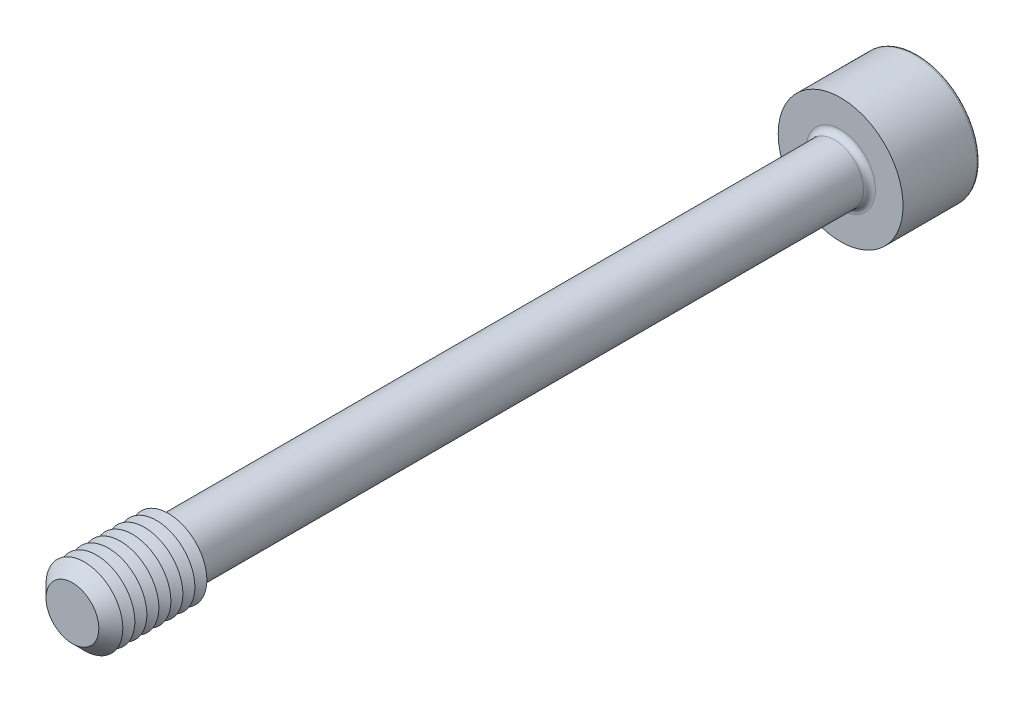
ISO-10303-21;
HEADER;
FILE_DESCRIPTION(('STEP AP214'),'2;1');
FILE_NAME('part.step','',(''),(''),'','','');
FILE_SCHEMA(('AUTOMOTIVE_DESIGN { 1 0 10303 214 1 1 1 1 }'));
ENDSEC;
DATA;
#1=APPLICATION_CONTEXT('core data for automotive mechanical design processes');
#2=APPLICATION_PROTOCOL_DEFINITION('international standard','automotive_design',2000,#1);
#3=PRODUCT_CONTEXT('',#1,'mechanical');
#4=PRODUCT('Part','Part','',(#3));
#5=PRODUCT_RELATED_PRODUCT_CATEGORY('part','',(#4));
#6=PRODUCT_DEFINITION_FORMATION('','',#4);
#7=PRODUCT_DEFINITION_CONTEXT('part definition',#1,'design');
#8=PRODUCT_DEFINITION('design','',#6,#7);
#9=PRODUCT_DEFINITION_SHAPE('','',#8);
#10=(LENGTH_UNIT() NAMED_UNIT(*) SI_UNIT(.MILLI.,.METRE.));
#11=(NAMED_UNIT(*) PLANE_ANGLE_UNIT() SI_UNIT($,.RADIAN.));
#12=(NAMED_UNIT(*) SI_UNIT($,.STERADIAN.) SOLID_ANGLE_UNIT());
#13=UNCERTAINTY_MEASURE_WITH_UNIT(LENGTH_MEASURE(1.E-05),#10,'distance_accuracy_value','');
#14=(GEOMETRIC_REPRESENTATION_CONTEXT(3) GLOBAL_UNCERTAINTY_ASSIGNED_CONTEXT((#13)) GLOBAL_UNIT_ASSIGNED_CONTEXT((#10,
#11,#12)) REPRESENTATION_CONTEXT('',''));
#15=CARTESIAN_POINT('',(0.,0.,0.));
#16=DIRECTION('',(0.,0.,1.));
#17=DIRECTION('',(1.,0.,0.));
#18=AXIS2_PLACEMENT_3D('',#15,#16,#17);
#19=CARTESIAN_POINT('',(-1.73205080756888,-3.,-42.));
#20=DIRECTION('',(0.,0.,1.));
#21=DIRECTION('',(1.,0.,0.));
#22=AXIS2_PLACEMENT_3D('',#19,#20,#21);
#23=PLANE('',#22);
#24=DIRECTION('',(1.,0.,0.));
#25=VECTOR('',#24,1.);
#26=CARTESIAN_POINT('',(-1.73205080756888,-3.,-42.));
#27=LINE('',#26,#25);
#28=CARTESIAN_POINT('',(0.,-3.,-42.));
#29=VERTEX_POINT('',#28);
#30=CARTESIAN_POINT('',(1.73205080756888,-3.,-42.));
#31=VERTEX_POINT('',#30);
#32=EDGE_CURVE('E404',#29,#31,#27,.T.);
#33=ORIENTED_EDGE('',*,*,#32,.F.);
#34=CARTESIAN_POINT('',(0.,0.,-42.));
#35=DIRECTION('',(0.,0.,1.));
#36=DIRECTION('',(0.,-1.,0.));
#37=AXIS2_PLACEMENT_3D('',#34,#35,#36);
#38=CIRCLE('',#37,3.);
#39=CARTESIAN_POINT('',(2.59807621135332,-1.5,-42.));
#40=VERTEX_POINT('',#39);
#41=EDGE_CURVE('E53',#29,#40,#38,.T.);
#42=ORIENTED_EDGE('',*,*,#41,.T.);
#43=DIRECTION('',(0.5,0.866025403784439,0.));
#44=VECTOR('',#43,1.);
#45=CARTESIAN_POINT('',(1.73205080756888,-3.,-42.));
#46=LINE('',#45,#44);
#47=EDGE_CURVE('E394',#31,#40,#46,.T.);
#48=ORIENTED_EDGE('',*,*,#47,.F.);
#49=EDGE_LOOP('',(#33,#42,#48));
#50=FACE_BOUND('',#49,.T.);
#51=ADVANCED_FACE('F41',(#50),#23,.F.);
#52=CARTESIAN_POINT('',(3.46410161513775,0.,-42.));
#53=VERTEX_POINT('',#52);
#54=EDGE_CURVE('E398',#40,#53,#46,.T.);
#55=ORIENTED_EDGE('',*,*,#54,.F.);
#56=CARTESIAN_POINT('',(2.59807621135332,1.5,-42.));
#57=VERTEX_POINT('',#56);
#58=EDGE_CURVE('E11',#40,#57,#38,.T.);
#59=ORIENTED_EDGE('',*,*,#58,.T.);
#60=DIRECTION('',(-0.5,0.866025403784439,0.));
#61=VECTOR('',#60,1.);
#62=CARTESIAN_POINT('',(3.46410161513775,0.,-42.));
#63=LINE('',#62,#61);
#64=EDGE_CURVE('E391',#53,#57,#63,.T.);
#65=ORIENTED_EDGE('',*,*,#64,.F.);
#66=EDGE_LOOP('',(#55,#59,#65));
#67=FACE_BOUND('',#66,.T.);
#68=ADVANCED_FACE('F133',(#67),#23,.F.);
#69=CARTESIAN_POINT('',(1.73205080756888,3.,-42.));
#70=VERTEX_POINT('',#69);
#71=EDGE_CURVE('E390',#57,#70,#63,.T.);
#72=ORIENTED_EDGE('',*,*,#71,.F.);
#73=CARTESIAN_POINT('',(0.,3.,-42.));
#74=VERTEX_POINT('',#73);
#75=EDGE_CURVE('E51',#57,#74,#38,.T.);
#76=ORIENTED_EDGE('',*,*,#75,.T.);
#77=DIRECTION('',(-1.,0.,0.));
#78=VECTOR('',#77,1.);
#79=CARTESIAN_POINT('',(1.73205080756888,3.,-42.));
#80=LINE('',#79,#78);
#81=EDGE_CURVE('E177',#70,#74,#80,.T.);
#82=ORIENTED_EDGE('',*,*,#81,.F.);
#83=EDGE_LOOP('',(#72,#76,#82));
#84=FACE_BOUND('',#83,.T.);
#85=ADVANCED_FACE('F139',(#84),#23,.F.);
#86=CARTESIAN_POINT('',(-1.73205080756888,3.,-42.));
#87=VERTEX_POINT('',#86);
#88=EDGE_CURVE('E395',#74,#87,#80,.T.);
#89=ORIENTED_EDGE('',*,*,#88,.F.);
#90=CARTESIAN_POINT('',(-2.59807621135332,1.5,-42.));
#91=VERTEX_POINT('',#90);
#92=EDGE_CURVE('E264',#74,#91,#38,.T.);
#93=ORIENTED_EDGE('',*,*,#92,.T.);
#94=DIRECTION('',(-0.5,-0.866025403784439,0.));
#95=VECTOR('',#94,1.);
#96=CARTESIAN_POINT('',(-1.73205080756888,3.,-42.));
#97=LINE('',#96,#95);
#98=EDGE_CURVE('E176',#87,#91,#97,.T.);
#99=ORIENTED_EDGE('',*,*,#98,.F.);
#100=EDGE_LOOP('',(#89,#93,#99));
#101=FACE_BOUND('',#100,.T.);
#102=ADVANCED_FACE('F157',(#101),#23,.F.);
#103=CARTESIAN_POINT('',(-3.46410161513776,0.,-42.));
#104=VERTEX_POINT('',#103);
#105=EDGE_CURVE('E170',#91,#104,#97,.T.);
#106=ORIENTED_EDGE('',*,*,#105,.F.);
#107=CARTESIAN_POINT('',(-2.59807621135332,-1.5,-42.));
#108=VERTEX_POINT('',#107);
#109=EDGE_CURVE('E172',#91,#108,#38,.T.);
#110=ORIENTED_EDGE('',*,*,#109,.T.);
#111=DIRECTION('',(0.5,-0.866025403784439,0.));
#112=VECTOR('',#111,1.);
#113=CARTESIAN_POINT('',(-3.46410161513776,0.,-42.));
#114=LINE('',#113,#112);
#115=EDGE_CURVE('E174',#104,#108,#114,.T.);
#116=ORIENTED_EDGE('',*,*,#115,.F.);
#117=EDGE_LOOP('',(#106,#110,#116));
#118=FACE_BOUND('',#117,.T.);
#119=ADVANCED_FACE('F146',(#118),#23,.F.);
#120=CARTESIAN_POINT('',(0.,0.,-48.));
#121=DIRECTION('',(0.,0.,-1.));
#122=DIRECTION('',(-1.,0.,0.));
#123=AXIS2_PLACEMENT_3D('',#120,#121,#122);
#124=PLANE('',#123);
#125=CARTESIAN_POINT('',(0.,0.,-48.));
#126=DIRECTION('',(0.,0.,-1.));
#127=DIRECTION('',(-1.,0.,0.));
#128=AXIS2_PLACEMENT_3D('',#125,#126,#127);
#129=CIRCLE('',#128,6.19);
#130=CARTESIAN_POINT('',(-6.19,0.,-48.));
#131=VERTEX_POINT('',#130);
#132=EDGE_CURVE('E249',#131,#131,#129,.T.);
#133=ORIENTED_EDGE('',*,*,#132,.T.);
#134=EDGE_LOOP('',(#133));
#135=FACE_BOUND('',#134,.T.);
#136=DIRECTION('',(-0.5,-0.866025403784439,0.));
#137=VECTOR('',#136,1.);
#138=CARTESIAN_POINT('',(-1.73205080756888,3.,-48.));
#139=LINE('',#138,#137);
#140=CARTESIAN_POINT('',(-1.73205080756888,3.,-48.));
#141=VERTEX_POINT('',#140);
#142=CARTESIAN_POINT('',(-3.46410161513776,0.,-48.));
#143=VERTEX_POINT('',#142);
#144=EDGE_CURVE('E211',#141,#143,#139,.T.);
#145=ORIENTED_EDGE('',*,*,#144,.T.);
#146=DIRECTION('',(0.5,-0.866025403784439,0.));
#147=VECTOR('',#146,1.);
#148=CARTESIAN_POINT('',(-3.46410161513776,0.,-48.));
#149=LINE('',#148,#147);
#150=CARTESIAN_POINT('',(-1.73205080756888,-3.,-48.));
#151=VERTEX_POINT('',#150);
#152=EDGE_CURVE('E67',#143,#151,#149,.T.);
#153=ORIENTED_EDGE('',*,*,#152,.T.);
#154=DIRECTION('',(1.,0.,0.));
#155=VECTOR('',#154,1.);
#156=CARTESIAN_POINT('',(-1.73205080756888,-3.,-48.));
#157=LINE('',#156,#155);
#158=CARTESIAN_POINT('',(1.73205080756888,-3.,-48.));
#159=VERTEX_POINT('',#158);
#160=EDGE_CURVE('E195',#151,#159,#157,.T.);
#161=ORIENTED_EDGE('',*,*,#160,.T.);
#162=DIRECTION('',(0.5,0.866025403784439,0.));
#163=VECTOR('',#162,1.);
#164=CARTESIAN_POINT('',(1.73205080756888,-3.,-48.));
#165=LINE('',#164,#163);
#166=CARTESIAN_POINT('',(3.46410161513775,0.,-48.));
#167=VERTEX_POINT('',#166);
#168=EDGE_CURVE('E199',#159,#167,#165,.T.);
#169=ORIENTED_EDGE('',*,*,#168,.T.);
#170=DIRECTION('',(-0.5,0.866025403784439,0.));
#171=VECTOR('',#170,1.);
#172=CARTESIAN_POINT('',(3.46410161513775,0.,-48.));
#173=LINE('',#172,#171);
#174=CARTESIAN_POINT('',(1.73205080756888,3.,-48.));
#175=VERTEX_POINT('',#174);
#176=EDGE_CURVE('E203',#167,#175,#173,.T.);
#177=ORIENTED_EDGE('',*,*,#176,.T.);
#178=DIRECTION('',(-1.,0.,0.));
#179=VECTOR('',#178,1.);
#180=CARTESIAN_POINT('',(1.73205080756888,3.,-48.));
#181=LINE('',#180,#179);
#182=EDGE_CURVE('E207',#175,#141,#181,.T.);
#183=ORIENTED_EDGE('',*,*,#182,.T.);
#184=EDGE_LOOP('',(#145,#153,#161,#169,#177,#183));
#185=FACE_BOUND('',#184,.T.);
#186=ADVANCED_FACE('F156',(#135,#185),#124,.T.);
#187=CARTESIAN_POINT('',(0.,0.,40.));
#188=DIRECTION('',(0.,0.,-1.));
#189=DIRECTION('',(-1.,0.,0.));
#190=AXIS2_PLACEMENT_3D('',#187,#188,#189);
#191=CYLINDRICAL_SURFACE('',#190,3.);
#192=CARTESIAN_POINT('',(0.,0.,-39.38));
#193=DIRECTION('',(0.,0.,-1.));
#194=DIRECTION('',(-1.,0.,0.));
#195=AXIS2_PLACEMENT_3D('',#192,#193,#194);
#196=CIRCLE('',#195,3.);
#197=CARTESIAN_POINT('',(-3.,0.,-39.38));
#198=VERTEX_POINT('',#197);
#199=EDGE_CURVE('E246',#198,#198,#196,.F.);
#200=ORIENTED_EDGE('',*,*,#199,.T.);
#201=EDGE_LOOP('',(#200));
#202=FACE_BOUND('',#201,.T.);
#203=CARTESIAN_POINT('',(0.,0.,29.4226497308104));
#204=DIRECTION('',(0.,0.,-1.));
#205=DIRECTION('',(0.,1.,0.));
#206=AXIS2_PLACEMENT_3D('',#203,#204,#205);
#207=CIRCLE('',#206,3.);
#208=CARTESIAN_POINT('',(0.,3.,29.4226497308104));
#209=VERTEX_POINT('',#208);
#210=EDGE_CURVE('E234',#209,#209,#207,.T.);
#211=ORIENTED_EDGE('',*,*,#210,.T.);
#212=EDGE_LOOP('',(#211));
#213=FACE_BOUND('',#212,.T.);
#214=ADVANCED_FACE('F163',(#202,#213),#191,.T.);
#215=CARTESIAN_POINT('',(0.,0.,29.4226497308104));
#216=DIRECTION('',(0.,0.,1.));
#217=DIRECTION('',(0.,-1.,0.));
#218=AXIS2_PLACEMENT_3D('',#215,#216,#217);
#219=CONICAL_SURFACE('',#218,3.,1.0471975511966);
#220=CARTESIAN_POINT('',(0.,0.,30.));
#221=DIRECTION('',(0.,0.,-1.));
#222=DIRECTION('',(-1.,0.,0.));
#223=AXIS2_PLACEMENT_3D('',#220,#221,#222);
#224=CIRCLE('',#223,4.);
#225=CARTESIAN_POINT('',(-4.,0.,30.));
#226=VERTEX_POINT('',#225);
#227=EDGE_CURVE('E268',#226,#226,#224,.T.);
#228=ORIENTED_EDGE('',*,*,#227,.T.);
#229=EDGE_LOOP('',(#228));
#230=FACE_BOUND('',#229,.T.);
#231=ORIENTED_EDGE('',*,*,#210,.F.);
#232=EDGE_LOOP('',(#231));
#233=FACE_BOUND('',#232,.T.);
#234=ADVANCED_FACE('F348',(#230,#233),#219,.T.);
#235=CARTESIAN_POINT('',(0.,0.,-40.));
#236=DIRECTION('',(0.,0.,-1.));
#237=DIRECTION('',(-1.,0.,0.));
#238=AXIS2_PLACEMENT_3D('',#235,#236,#237);
#239=PLANE('',#238);
#240=CARTESIAN_POINT('',(0.,0.,-40.));
#241=DIRECTION('',(0.,0.,-1.));
#242=DIRECTION('',(-1.,0.,0.));
#243=AXIS2_PLACEMENT_3D('',#240,#241,#242);
#244=CIRCLE('',#243,3.62);
#245=CARTESIAN_POINT('',(-3.62,0.,-40.));
#246=VERTEX_POINT('',#245);
#247=EDGE_CURVE('E242',#246,#246,#244,.T.);
#248=ORIENTED_EDGE('',*,*,#247,.T.);
#249=EDGE_LOOP('',(#248));
#250=FACE_BOUND('',#249,.T.);
#251=CARTESIAN_POINT('',(0.,0.,-40.));
#252=DIRECTION('',(0.,0.,-1.));
#253=DIRECTION('',(-1.,0.,0.));
#254=AXIS2_PLACEMENT_3D('',#251,#252,#253);
#255=CIRCLE('',#254,6.5);
#256=CARTESIAN_POINT('',(-6.5,0.,-40.));
#257=VERTEX_POINT('',#256);
#258=EDGE_CURVE('E230',#257,#257,#255,.T.);
#259=ORIENTED_EDGE('',*,*,#258,.F.);
#260=EDGE_LOOP('',(#259));
#261=FACE_BOUND('',#260,.T.);
#262=ADVANCED_FACE('F353',(#250,#261),#239,.F.);
#263=CARTESIAN_POINT('',(0.,0.,-48.));
#264=DIRECTION('',(0.,0.,1.));
#265=DIRECTION('',(1.,0.,0.));
#266=AXIS2_PLACEMENT_3D('',#263,#264,#265);
#267=CYLINDRICAL_SURFACE('',#266,6.5);
#268=CARTESIAN_POINT('',(0.,0.,-47.69));
#269=DIRECTION('',(0.,0.,-1.));
#270=DIRECTION('',(-1.,0.,0.));
#271=AXIS2_PLACEMENT_3D('',#268,#269,#270);
#272=CIRCLE('',#271,6.5);
#273=CARTESIAN_POINT('',(-6.5,0.,-47.69));
#274=VERTEX_POINT('',#273);
#275=EDGE_CURVE('E45',#274,#274,#272,.F.);
#276=ORIENTED_EDGE('',*,*,#275,.T.);
#277=EDGE_LOOP('',(#276));
#278=FACE_BOUND('',#277,.T.);
#279=ORIENTED_EDGE('',*,*,#258,.T.);
#280=EDGE_LOOP('',(#279));
#281=FACE_BOUND('',#280,.T.);
#282=ADVANCED_FACE('F354',(#278,#281),#267,.T.);
#283=CARTESIAN_POINT('',(-3.46410161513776,0.,-42.));
#284=DIRECTION('',(0.866025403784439,0.5,0.));
#285=DIRECTION('',(-0.5,0.866025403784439,0.));
#286=AXIS2_PLACEMENT_3D('',#283,#284,#285);
#287=PLANE('',#286);
#288=ORIENTED_EDGE('',*,*,#152,.F.);
#289=DIRECTION('',(0.,0.,-1.));
#290=VECTOR('',#289,1.);
#291=CARTESIAN_POINT('',(-3.46410161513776,0.,-42.));
#292=LINE('',#291,#290);
#293=EDGE_CURVE('E186',#104,#143,#292,.T.);
#294=ORIENTED_EDGE('',*,*,#293,.F.);
#295=ORIENTED_EDGE('',*,*,#115,.T.);
#296=CARTESIAN_POINT('',(-1.73205080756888,-3.,-42.));
#297=VERTEX_POINT('',#296);
#298=EDGE_CURVE('E214',#108,#297,#114,.T.);
#299=ORIENTED_EDGE('',*,*,#298,.T.);
#300=DIRECTION('',(0.,0.,-1.));
#301=VECTOR('',#300,1.);
#302=CARTESIAN_POINT('',(-1.73205080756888,-3.,-42.));
#303=LINE('',#302,#301);
#304=EDGE_CURVE('E227',#297,#151,#303,.T.);
#305=ORIENTED_EDGE('',*,*,#304,.T.);
#306=EDGE_LOOP('',(#288,#294,#295,#299,#305));
#307=FACE_BOUND('',#306,.T.);
#308=ADVANCED_FACE('F357',(#307),#287,.T.);
#309=CARTESIAN_POINT('',(-1.73205080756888,-3.,-42.));
#310=DIRECTION('',(0.,1.,0.));
#311=DIRECTION('',(0.,0.,1.));
#312=AXIS2_PLACEMENT_3D('',#309,#310,#311);
#313=PLANE('',#312);
#314=ORIENTED_EDGE('',*,*,#160,.F.);
#315=ORIENTED_EDGE('',*,*,#304,.F.);
#316=EDGE_CURVE('E401',#297,#29,#27,.T.);
#317=ORIENTED_EDGE('',*,*,#316,.T.);
#318=ORIENTED_EDGE('',*,*,#32,.T.);
#319=DIRECTION('',(0.,0.,-1.));
#320=VECTOR('',#319,1.);
#321=CARTESIAN_POINT('',(1.73205080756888,-3.,-42.));
#322=LINE('',#321,#320);
#323=EDGE_CURVE('E224',#31,#159,#322,.T.);
#324=ORIENTED_EDGE('',*,*,#323,.T.);
#325=EDGE_LOOP('',(#314,#315,#317,#318,#324));
#326=FACE_BOUND('',#325,.T.);
#327=ADVANCED_FACE('F363',(#326),#313,.T.);
#328=CARTESIAN_POINT('',(1.73205080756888,-3.,-42.));
#329=DIRECTION('',(-0.866025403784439,0.5,0.));
#330=DIRECTION('',(-0.5,-0.866025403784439,0.));
#331=AXIS2_PLACEMENT_3D('',#328,#329,#330);
#332=PLANE('',#331);
#333=ORIENTED_EDGE('',*,*,#168,.F.);
#334=ORIENTED_EDGE('',*,*,#323,.F.);
#335=ORIENTED_EDGE('',*,*,#47,.T.);
#336=ORIENTED_EDGE('',*,*,#54,.T.);
#337=DIRECTION('',(0.,0.,-1.));
#338=VECTOR('',#337,1.);
#339=CARTESIAN_POINT('',(3.46410161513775,0.,-42.));
#340=LINE('',#339,#338);
#341=EDGE_CURVE('E221',#53,#167,#340,.T.);
#342=ORIENTED_EDGE('',*,*,#341,.T.);
#343=EDGE_LOOP('',(#333,#334,#335,#336,#342));
#344=FACE_BOUND('',#343,.T.);
#345=ADVANCED_FACE('F366',(#344),#332,.T.);
#346=CARTESIAN_POINT('',(3.46410161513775,0.,-42.));
#347=DIRECTION('',(-0.866025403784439,-0.5,0.));
#348=DIRECTION('',(0.5,-0.866025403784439,0.));
#349=AXIS2_PLACEMENT_3D('',#346,#347,#348);
#350=PLANE('',#349);
#351=ORIENTED_EDGE('',*,*,#176,.F.);
#352=ORIENTED_EDGE('',*,*,#341,.F.);
#353=ORIENTED_EDGE('',*,*,#64,.T.);
#354=ORIENTED_EDGE('',*,*,#71,.T.);
#355=DIRECTION('',(0.,0.,-1.));
#356=VECTOR('',#355,1.);
#357=CARTESIAN_POINT('',(1.73205080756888,3.,-42.));
#358=LINE('',#357,#356);
#359=EDGE_CURVE('E218',#70,#175,#358,.T.);
#360=ORIENTED_EDGE('',*,*,#359,.T.);
#361=EDGE_LOOP('',(#351,#352,#353,#354,#360));
#362=FACE_BOUND('',#361,.T.);
#363=ADVANCED_FACE('F370',(#362),#350,.T.);
#364=CARTESIAN_POINT('',(1.73205080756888,3.,-42.));
#365=DIRECTION('',(0.,-1.,0.));
#366=DIRECTION('',(1.,0.,0.));
#367=AXIS2_PLACEMENT_3D('',#364,#365,#366);
#368=PLANE('',#367);
#369=ORIENTED_EDGE('',*,*,#182,.F.);
#370=ORIENTED_EDGE('',*,*,#359,.F.);
#371=ORIENTED_EDGE('',*,*,#81,.T.);
#372=ORIENTED_EDGE('',*,*,#88,.T.);
#373=DIRECTION('',(0.,0.,-1.));
#374=VECTOR('',#373,1.);
#375=CARTESIAN_POINT('',(-1.73205080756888,3.,-42.));
#376=LINE('',#375,#374);
#377=EDGE_CURVE('E182',#87,#141,#376,.T.);
#378=ORIENTED_EDGE('',*,*,#377,.T.);
#379=EDGE_LOOP('',(#369,#370,#371,#372,#378));
#380=FACE_BOUND('',#379,.T.);
#381=ADVANCED_FACE('F152',(#380),#368,.T.);
#382=CARTESIAN_POINT('',(-1.73205080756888,3.,-42.));
#383=DIRECTION('',(0.866025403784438,-0.5,0.));
#384=DIRECTION('',(0.5,0.866025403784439,0.));
#385=AXIS2_PLACEMENT_3D('',#382,#383,#384);
#386=PLANE('',#385);
#387=ORIENTED_EDGE('',*,*,#144,.F.);
#388=ORIENTED_EDGE('',*,*,#377,.F.);
#389=ORIENTED_EDGE('',*,*,#98,.T.);
#390=ORIENTED_EDGE('',*,*,#105,.T.);
#391=ORIENTED_EDGE('',*,*,#293,.T.);
#392=EDGE_LOOP('',(#387,#388,#389,#390,#391));
#393=FACE_BOUND('',#392,.T.);
#394=ADVANCED_FACE('F144',(#393),#386,.T.);
#395=ORIENTED_EDGE('',*,*,#298,.F.);
#396=EDGE_CURVE('E255',#108,#29,#38,.T.);
#397=ORIENTED_EDGE('',*,*,#396,.T.);
#398=ORIENTED_EDGE('',*,*,#316,.F.);
#399=EDGE_LOOP('',(#395,#397,#398));
#400=FACE_BOUND('',#399,.T.);
#401=ADVANCED_FACE('F135',(#400),#23,.F.);
#402=CARTESIAN_POINT('',(0.,0.,-39.38));
#403=DIRECTION('',(0.,0.,-1.));
#404=DIRECTION('',(-1.,0.,0.));
#405=AXIS2_PLACEMENT_3D('',#402,#403,#404);
#406=TOROIDAL_SURFACE('',#405,3.62,0.62);
#407=ORIENTED_EDGE('',*,*,#199,.F.);
#408=EDGE_LOOP('',(#407));
#409=FACE_BOUND('',#408,.T.);
#410=ORIENTED_EDGE('',*,*,#247,.F.);
#411=EDGE_LOOP('',(#410));
#412=FACE_BOUND('',#411,.T.);
#413=ADVANCED_FACE('F129',(#409,#412),#406,.F.);
#414=CARTESIAN_POINT('',(0.,0.,-47.69));
#415=DIRECTION('',(0.,0.,-1.));
#416=DIRECTION('',(-1.,0.,0.));
#417=AXIS2_PLACEMENT_3D('',#414,#415,#416);
#418=TOROIDAL_SURFACE('',#417,6.19,0.31);
#419=ORIENTED_EDGE('',*,*,#275,.F.);
#420=EDGE_LOOP('',(#419));
#421=FACE_BOUND('',#420,.T.);
#422=ORIENTED_EDGE('',*,*,#132,.F.);
#423=EDGE_LOOP('',(#422));
#424=FACE_BOUND('',#423,.T.);
#425=ADVANCED_FACE('F43',(#421,#424),#418,.T.);
#426=CARTESIAN_POINT('',(0.,0.,-40.2679491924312));
#427=DIRECTION('',(0.,0.,-1.));
#428=DIRECTION('',(0.,1.,0.));
#429=AXIS2_PLACEMENT_3D('',#426,#427,#428);
#430=CONICAL_SURFACE('',#429,0.,1.04719755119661);
#431=ORIENTED_EDGE('',*,*,#41,.F.);
#432=ORIENTED_EDGE('',*,*,#396,.F.);
#433=ORIENTED_EDGE('',*,*,#109,.F.);
#434=ORIENTED_EDGE('',*,*,#92,.F.);
#435=ORIENTED_EDGE('',*,*,#75,.F.);
#436=ORIENTED_EDGE('',*,*,#58,.F.);
#437=EDGE_LOOP('',(#431,#432,#433,#434,#435,#436));
#438=FACE_BOUND('',#437,.T.);
#439=CARTESIAN_POINT('',(0.,0.,-40.2679491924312));
#440=VERTEX_POINT('',#439);
#441=VERTEX_LOOP('',#440);
#442=FACE_BOUND('',#441,.T.);
#443=ADVANCED_FACE('F118',(#438,#442),#430,.F.);
#444=CARTESIAN_POINT('',(0.,0.,30.625));
#445=DIRECTION('',(0.,0.,-1.));
#446=DIRECTION('',(-1.,0.,0.));
#447=AXIS2_PLACEMENT_3D('',#444,#445,#446);
#448=CONICAL_SURFACE('',#447,2.91746824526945,1.0471975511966);
#449=ORIENTED_EDGE('',*,*,#227,.F.);
#450=EDGE_LOOP('',(#449));
#451=FACE_BOUND('',#450,.T.);
#452=CARTESIAN_POINT('',(0.,0.,30.625));
#453=DIRECTION('',(0.,0.,-1.));
#454=DIRECTION('',(-1.,0.,0.));
#455=AXIS2_PLACEMENT_3D('',#452,#453,#454);
#456=CIRCLE('',#455,2.91746824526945);
#457=CARTESIAN_POINT('',(-2.91746824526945,0.,30.625));
#458=VERTEX_POINT('',#457);
#459=EDGE_CURVE('E274',#458,#458,#456,.T.);
#460=ORIENTED_EDGE('',*,*,#459,.T.);
#461=EDGE_LOOP('',(#460));
#462=FACE_BOUND('',#461,.T.);
#463=ADVANCED_FACE('F120',(#451,#462),#448,.T.);
#464=CARTESIAN_POINT('',(0.,0.,31.25));
#465=DIRECTION('',(0.,0.,1.));
#466=DIRECTION('',(1.,0.,0.));
#467=AXIS2_PLACEMENT_3D('',#464,#465,#466);
#468=CONICAL_SURFACE('',#467,4.,1.0471975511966);
#469=ORIENTED_EDGE('',*,*,#459,.F.);
#470=EDGE_LOOP('',(#469));
#471=FACE_BOUND('',#470,.T.);
#472=CARTESIAN_POINT('',(0.,0.,31.25));
#473=DIRECTION('',(0.,0.,-1.));
#474=DIRECTION('',(-1.,0.,0.));
#475=AXIS2_PLACEMENT_3D('',#472,#473,#474);
#476=CIRCLE('',#475,4.);
#477=CARTESIAN_POINT('',(-4.,0.,31.25));
#478=VERTEX_POINT('',#477);
#479=EDGE_CURVE('E281',#478,#478,#476,.T.);
#480=ORIENTED_EDGE('',*,*,#479,.T.);
#481=EDGE_LOOP('',(#480));
#482=FACE_BOUND('',#481,.T.);
#483=ADVANCED_FACE('F126',(#471,#482),#468,.T.);
#484=CARTESIAN_POINT('',(0.,0.,31.875));
#485=DIRECTION('',(0.,0.,-1.));
#486=DIRECTION('',(-1.,0.,0.));
#487=AXIS2_PLACEMENT_3D('',#484,#485,#486);
#488=CONICAL_SURFACE('',#487,2.91746824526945,1.0471975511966);
#489=ORIENTED_EDGE('',*,*,#479,.F.);
#490=EDGE_LOOP('',(#489));
#491=FACE_BOUND('',#490,.T.);
#492=CARTESIAN_POINT('',(0.,0.,31.875));
#493=DIRECTION('',(0.,0.,-1.));
#494=DIRECTION('',(-1.,0.,0.));
#495=AXIS2_PLACEMENT_3D('',#492,#493,#494);
#496=CIRCLE('',#495,2.91746824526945);
#497=CARTESIAN_POINT('',(-2.91746824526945,0.,31.875));
#498=VERTEX_POINT('',#497);
#499=EDGE_CURVE('E287',#498,#498,#496,.T.);
#500=ORIENTED_EDGE('',*,*,#499,.T.);
#501=EDGE_LOOP('',(#500));
#502=FACE_BOUND('',#501,.T.);
#503=ADVANCED_FACE('F508',(#491,#502),#488,.T.);
#504=CARTESIAN_POINT('',(0.,0.,32.5));
#505=DIRECTION('',(0.,0.,1.));
#506=DIRECTION('',(1.,0.,0.));
#507=AXIS2_PLACEMENT_3D('',#504,#505,#506);
#508=CONICAL_SURFACE('',#507,4.,1.0471975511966);
#509=ORIENTED_EDGE('',*,*,#499,.F.);
#510=EDGE_LOOP('',(#509));
#511=FACE_BOUND('',#510,.T.);
#512=CARTESIAN_POINT('',(0.,0.,32.5));
#513=DIRECTION('',(0.,0.,-1.));
#514=DIRECTION('',(-1.,0.,0.));
#515=AXIS2_PLACEMENT_3D('',#512,#513,#514);
#516=CIRCLE('',#515,4.);
#517=CARTESIAN_POINT('',(-4.,0.,32.5));
#518=VERTEX_POINT('',#517);
#519=EDGE_CURVE('E291',#518,#518,#516,.T.);
#520=ORIENTED_EDGE('',*,*,#519,.T.);
#521=EDGE_LOOP('',(#520));
#522=FACE_BOUND('',#521,.T.);
#523=ADVANCED_FACE('F517',(#511,#522),#508,.T.);
#524=CARTESIAN_POINT('',(0.,0.,33.125));
#525=DIRECTION('',(0.,0.,-1.));
#526=DIRECTION('',(-1.,0.,0.));
#527=AXIS2_PLACEMENT_3D('',#524,#525,#526);
#528=CONICAL_SURFACE('',#527,2.91746824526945,1.0471975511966);
#529=ORIENTED_EDGE('',*,*,#519,.F.);
#530=EDGE_LOOP('',(#529));
#531=FACE_BOUND('',#530,.T.);
#532=CARTESIAN_POINT('',(0.,0.,33.125));
#533=DIRECTION('',(0.,0.,-1.));
#534=DIRECTION('',(-1.,0.,0.));
#535=AXIS2_PLACEMENT_3D('',#532,#533,#534);
#536=CIRCLE('',#535,2.91746824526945);
#537=CARTESIAN_POINT('',(-2.91746824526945,0.,33.125));
#538=VERTEX_POINT('',#537);
#539=EDGE_CURVE('E294',#538,#538,#536,.T.);
#540=ORIENTED_EDGE('',*,*,#539,.T.);
#541=EDGE_LOOP('',(#540));
#542=FACE_BOUND('',#541,.T.);
#543=ADVANCED_FACE('F526',(#531,#542),#528,.T.);
#544=CARTESIAN_POINT('',(0.,0.,33.75));
#545=DIRECTION('',(0.,0.,1.));
#546=DIRECTION('',(1.,0.,0.));
#547=AXIS2_PLACEMENT_3D('',#544,#545,#546);
#548=CONICAL_SURFACE('',#547,4.,1.0471975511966);
#549=ORIENTED_EDGE('',*,*,#539,.F.);
#550=EDGE_LOOP('',(#549));
#551=FACE_BOUND('',#550,.T.);
#552=CARTESIAN_POINT('',(0.,0.,33.75));
#553=DIRECTION('',(0.,0.,-1.));
#554=DIRECTION('',(-1.,0.,0.));
#555=AXIS2_PLACEMENT_3D('',#552,#553,#554);
#556=CIRCLE('',#555,4.);
#557=CARTESIAN_POINT('',(-4.,0.,33.75));
#558=VERTEX_POINT('',#557);
#559=EDGE_CURVE('E298',#558,#558,#556,.T.);
#560=ORIENTED_EDGE('',*,*,#559,.T.);
#561=EDGE_LOOP('',(#560));
#562=FACE_BOUND('',#561,.T.);
#563=ADVANCED_FACE('F535',(#551,#562),#548,.T.);
#564=CARTESIAN_POINT('',(0.,0.,34.375));
#565=DIRECTION('',(0.,0.,-1.));
#566=DIRECTION('',(-1.,0.,0.));
#567=AXIS2_PLACEMENT_3D('',#564,#565,#566);
#568=CONICAL_SURFACE('',#567,2.91746824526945,1.0471975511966);
#569=ORIENTED_EDGE('',*,*,#559,.F.);
#570=EDGE_LOOP('',(#569));
#571=FACE_BOUND('',#570,.T.);
#572=CARTESIAN_POINT('',(0.,0.,34.375));
#573=DIRECTION('',(0.,0.,-1.));
#574=DIRECTION('',(-1.,0.,0.));
#575=AXIS2_PLACEMENT_3D('',#572,#573,#574);
#576=CIRCLE('',#575,2.91746824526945);
#577=CARTESIAN_POINT('',(-2.91746824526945,0.,34.375));
#578=VERTEX_POINT('',#577);
#579=EDGE_CURVE('E301',#578,#578,#576,.T.);
#580=ORIENTED_EDGE('',*,*,#579,.T.);
#581=EDGE_LOOP('',(#580));
#582=FACE_BOUND('',#581,.T.);
#583=ADVANCED_FACE('F544',(#571,#582),#568,.T.);
#584=CARTESIAN_POINT('',(0.,0.,35.));
#585=DIRECTION('',(0.,0.,1.));
#586=DIRECTION('',(1.,0.,0.));
#587=AXIS2_PLACEMENT_3D('',#584,#585,#586);
#588=CONICAL_SURFACE('',#587,4.,1.0471975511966);
#589=ORIENTED_EDGE('',*,*,#579,.F.);
#590=EDGE_LOOP('',(#589));
#591=FACE_BOUND('',#590,.T.);
#592=CARTESIAN_POINT('',(0.,0.,35.));
#593=DIRECTION('',(0.,0.,-1.));
#594=DIRECTION('',(-1.,0.,0.));
#595=AXIS2_PLACEMENT_3D('',#592,#593,#594);
#596=CIRCLE('',#595,4.);
#597=CARTESIAN_POINT('',(-4.,0.,35.));
#598=VERTEX_POINT('',#597);
#599=EDGE_CURVE('E304',#598,#598,#596,.T.);
#600=ORIENTED_EDGE('',*,*,#599,.T.);
#601=EDGE_LOOP('',(#600));
#602=FACE_BOUND('',#601,.T.);
#603=ADVANCED_FACE('F553',(#591,#602),#588,.T.);
#604=CARTESIAN_POINT('',(0.,0.,35.625));
#605=DIRECTION('',(0.,0.,-1.));
#606=DIRECTION('',(-1.,0.,0.));
#607=AXIS2_PLACEMENT_3D('',#604,#605,#606);
#608=CONICAL_SURFACE('',#607,2.91746824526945,1.0471975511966);
#609=ORIENTED_EDGE('',*,*,#599,.F.);
#610=EDGE_LOOP('',(#609));
#611=FACE_BOUND('',#610,.T.);
#612=CARTESIAN_POINT('',(0.,0.,35.625));
#613=DIRECTION('',(0.,0.,-1.));
#614=DIRECTION('',(-1.,0.,0.));
#615=AXIS2_PLACEMENT_3D('',#612,#613,#614);
#616=CIRCLE('',#615,2.91746824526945);
#617=CARTESIAN_POINT('',(-2.91746824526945,0.,35.625));
#618=VERTEX_POINT('',#617);
#619=EDGE_CURVE('E308',#618,#618,#616,.T.);
#620=ORIENTED_EDGE('',*,*,#619,.T.);
#621=EDGE_LOOP('',(#620));
#622=FACE_BOUND('',#621,.T.);
#623=ADVANCED_FACE('F562',(#611,#622),#608,.T.);
#624=CARTESIAN_POINT('',(0.,0.,36.25));
#625=DIRECTION('',(0.,0.,1.));
#626=DIRECTION('',(1.,0.,0.));
#627=AXIS2_PLACEMENT_3D('',#624,#625,#626);
#628=CONICAL_SURFACE('',#627,4.,1.0471975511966);
#629=ORIENTED_EDGE('',*,*,#619,.F.);
#630=EDGE_LOOP('',(#629));
#631=FACE_BOUND('',#630,.T.);
#632=CARTESIAN_POINT('',(0.,0.,36.25));
#633=DIRECTION('',(0.,0.,-1.));
#634=DIRECTION('',(-1.,0.,0.));
#635=AXIS2_PLACEMENT_3D('',#632,#633,#634);
#636=CIRCLE('',#635,4.);
#637=CARTESIAN_POINT('',(-4.,0.,36.25));
#638=VERTEX_POINT('',#637);
#639=EDGE_CURVE('E312',#638,#638,#636,.T.);
#640=ORIENTED_EDGE('',*,*,#639,.T.);
#641=EDGE_LOOP('',(#640));
#642=FACE_BOUND('',#641,.T.);
#643=ADVANCED_FACE('F571',(#631,#642),#628,.T.);
#644=CARTESIAN_POINT('',(0.,0.,36.875));
#645=DIRECTION('',(0.,0.,-1.));
#646=DIRECTION('',(-1.,0.,0.));
#647=AXIS2_PLACEMENT_3D('',#644,#645,#646);
#648=CONICAL_SURFACE('',#647,2.91746824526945,1.0471975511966);
#649=ORIENTED_EDGE('',*,*,#639,.F.);
#650=EDGE_LOOP('',(#649));
#651=FACE_BOUND('',#650,.T.);
#652=CARTESIAN_POINT('',(0.,0.,36.875));
#653=DIRECTION('',(0.,0.,-1.));
#654=DIRECTION('',(-1.,0.,0.));
#655=AXIS2_PLACEMENT_3D('',#652,#653,#654);
#656=CIRCLE('',#655,2.91746824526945);
#657=CARTESIAN_POINT('',(-2.91746824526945,0.,36.875));
#658=VERTEX_POINT('',#657);
#659=EDGE_CURVE('E316',#658,#658,#656,.T.);
#660=ORIENTED_EDGE('',*,*,#659,.T.);
#661=EDGE_LOOP('',(#660));
#662=FACE_BOUND('',#661,.T.);
#663=ADVANCED_FACE('F580',(#651,#662),#648,.T.);
#664=CARTESIAN_POINT('',(0.,0.,37.5));
#665=DIRECTION('',(0.,0.,1.));
#666=DIRECTION('',(1.,0.,0.));
#667=AXIS2_PLACEMENT_3D('',#664,#665,#666);
#668=CONICAL_SURFACE('',#667,4.,1.0471975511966);
#669=ORIENTED_EDGE('',*,*,#659,.F.);
#670=EDGE_LOOP('',(#669));
#671=FACE_BOUND('',#670,.T.);
#672=CARTESIAN_POINT('',(0.,0.,37.5));
#673=DIRECTION('',(0.,0.,-1.));
#674=DIRECTION('',(-1.,0.,0.));
#675=AXIS2_PLACEMENT_3D('',#672,#673,#674);
#676=CIRCLE('',#675,4.);
#677=CARTESIAN_POINT('',(-4.,0.,37.5));
#678=VERTEX_POINT('',#677);
#679=EDGE_CURVE('E320',#678,#678,#676,.T.);
#680=ORIENTED_EDGE('',*,*,#679,.T.);
#681=EDGE_LOOP('',(#680));
#682=FACE_BOUND('',#681,.T.);
#683=ADVANCED_FACE('F589',(#671,#682),#668,.T.);
#684=CARTESIAN_POINT('',(0.,0.,38.125));
#685=DIRECTION('',(0.,0.,-1.));
#686=DIRECTION('',(-1.,0.,0.));
#687=AXIS2_PLACEMENT_3D('',#684,#685,#686);
#688=CONICAL_SURFACE('',#687,2.91746824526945,1.0471975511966);
#689=ORIENTED_EDGE('',*,*,#679,.F.);
#690=EDGE_LOOP('',(#689));
#691=FACE_BOUND('',#690,.T.);
#692=CARTESIAN_POINT('',(0.,0.,38.125));
#693=DIRECTION('',(0.,0.,-1.));
#694=DIRECTION('',(-1.,0.,0.));
#695=AXIS2_PLACEMENT_3D('',#692,#693,#694);
#696=CIRCLE('',#695,2.91746824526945);
#697=CARTESIAN_POINT('',(-2.91746824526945,0.,38.125));
#698=VERTEX_POINT('',#697);
#699=EDGE_CURVE('E324',#698,#698,#696,.T.);
#700=ORIENTED_EDGE('',*,*,#699,.T.);
#701=EDGE_LOOP('',(#700));
#702=FACE_BOUND('',#701,.T.);
#703=ADVANCED_FACE('F598',(#691,#702),#688,.T.);
#704=CARTESIAN_POINT('',(0.,0.,38.75));
#705=DIRECTION('',(0.,0.,1.));
#706=DIRECTION('',(1.,0.,0.));
#707=AXIS2_PLACEMENT_3D('',#704,#705,#706);
#708=CONICAL_SURFACE('',#707,4.,1.0471975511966);
#709=ORIENTED_EDGE('',*,*,#699,.F.);
#710=EDGE_LOOP('',(#709));
#711=FACE_BOUND('',#710,.T.);
#712=CARTESIAN_POINT('',(0.,0.,38.75));
#713=DIRECTION('',(0.,0.,-1.));
#714=DIRECTION('',(-1.,0.,0.));
#715=AXIS2_PLACEMENT_3D('',#712,#713,#714);
#716=CIRCLE('',#715,4.);
#717=CARTESIAN_POINT('',(-4.,0.,38.75));
#718=VERTEX_POINT('',#717);
#719=EDGE_CURVE('E328',#718,#718,#716,.T.);
#720=ORIENTED_EDGE('',*,*,#719,.T.);
#721=EDGE_LOOP('',(#720));
#722=FACE_BOUND('',#721,.T.);
#723=ADVANCED_FACE('F333',(#711,#722),#708,.T.);
#724=CARTESIAN_POINT('',(0.,0.,40.));
#725=DIRECTION('',(0.,0.,1.));
#726=DIRECTION('',(1.,0.,0.));
#727=AXIS2_PLACEMENT_3D('',#724,#725,#726);
#728=PLANE('',#727);
#729=CARTESIAN_POINT('',(0.,0.,40.));
#730=DIRECTION('',(0.,0.,1.));
#731=DIRECTION('',(1.,0.,0.));
#732=AXIS2_PLACEMENT_3D('',#729,#730,#731);
#733=CIRCLE('',#732,2.74999999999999);
#734=CARTESIAN_POINT('',(2.74999999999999,0.,40.));
#735=VERTEX_POINT('',#734);
#736=EDGE_CURVE('E238',#735,#735,#733,.T.);
#737=ORIENTED_EDGE('',*,*,#736,.T.);
#738=EDGE_LOOP('',(#737));
#739=FACE_BOUND('',#738,.T.);
#740=ADVANCED_FACE('F337',(#739),#728,.T.);
#741=CARTESIAN_POINT('',(0.,0.,38.75));
#742=DIRECTION('',(0.,0.,-1.));
#743=DIRECTION('',(0.,1.,0.));
#744=AXIS2_PLACEMENT_3D('',#741,#742,#743);
#745=CONICAL_SURFACE('',#744,4.,0.785398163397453);
#746=ORIENTED_EDGE('',*,*,#736,.F.);
#747=EDGE_LOOP('',(#746));
#748=FACE_BOUND('',#747,.T.);
#749=ORIENTED_EDGE('',*,*,#719,.F.);
#750=EDGE_LOOP('',(#749));
#751=FACE_BOUND('',#750,.T.);
#752=ADVANCED_FACE('F335',(#748,#751),#745,.T.);
#753=CLOSED_SHELL('',(#51,#68,#85,#102,#119,#186,#214,#234,#262,#282,#308,#327,#345,#363,#381,
#394,#401,#413,#425,#443,#463,#483,#503,#523,#543,#563,#583,#603,#623,#643,#663,#683,#703,#723,
#740,#752));
#754=MANIFOLD_SOLID_BREP('B2',#753);
#755=ADVANCED_BREP_SHAPE_REPRESENTATION('',(#18,#754),#14);
#756=SHAPE_DEFINITION_REPRESENTATION(#9,#755);
ENDSEC;
END-ISO-10303-21;
